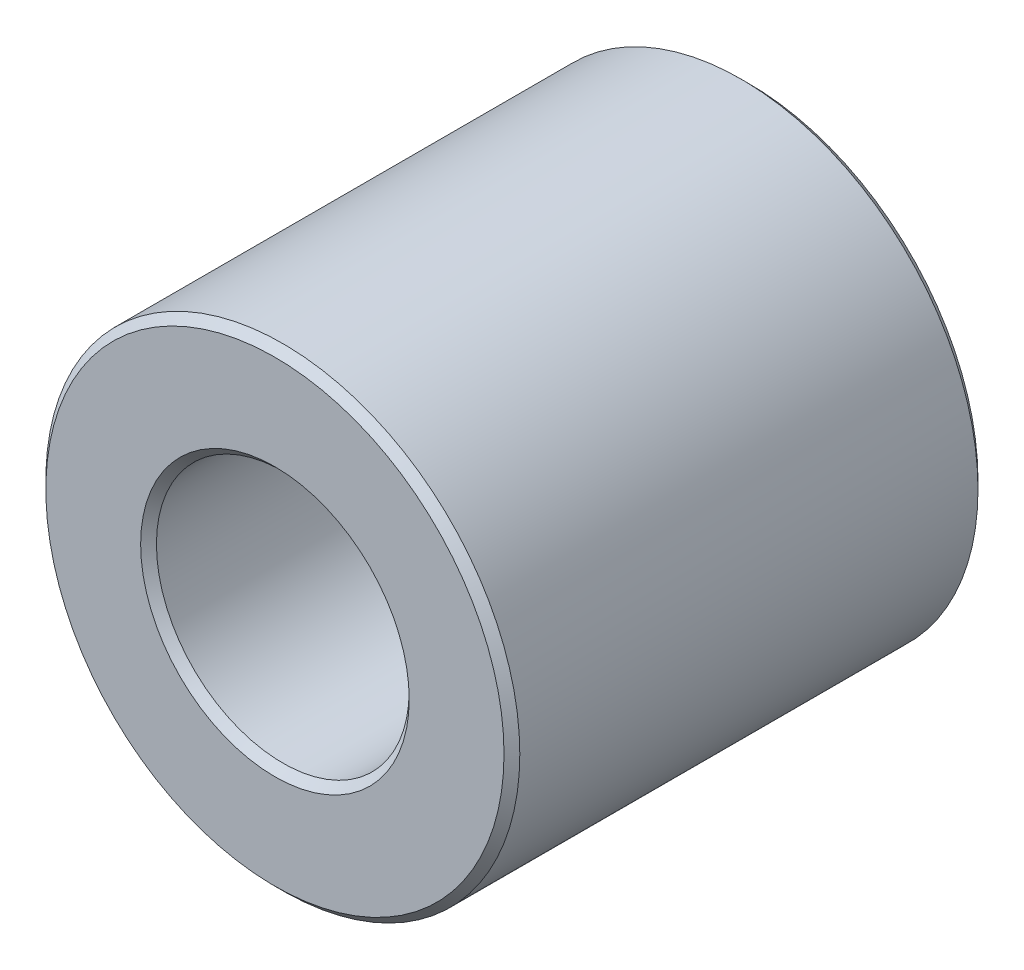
from build123d import *

# Parameters (mm, degrees)
SKETCH1_R           = 3
SKETCH1_R_2         = 1.6
BOSS_EXTRUDE2_DEPTH = 3
CHAMFER3_SIZE       = 0.1


with BuildPart() as part:
    # Sketch1 → Boss-Extrude2 (new, symmetric)
    with BuildSketch(Plane.XY):
        Circle(SKETCH1_R)
        Circle(SKETCH1_R_2, mode=Mode.SUBTRACT)
    extrude(amount=BOSS_EXTRUDE2_DEPTH, both=True)

    # Chamfer3
    chamfer3_edges = [part.edges().sort_by_distance(p)[0] for p in [
        (-3, 0, -3),
        (-3, 0, 3),
        (-1.6, 0, -3),
        (-1.6, 0, 3),
    ]]
    chamfer(chamfer3_edges, length=CHAMFER3_SIZE)


solid = part.part
